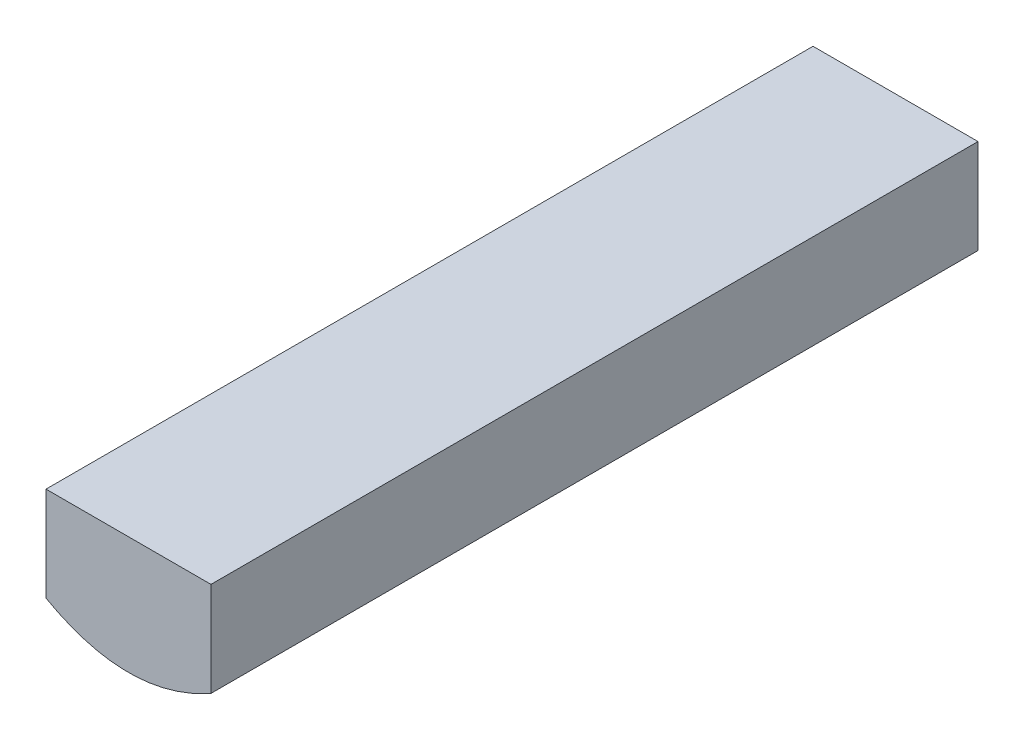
from build123d import *

# Parameters (mm, degrees)
BOSS_EXTRUDE2_DEPTH = 331.382
SKETCH5_W           = 260
SKETCH5_H           = 120
CUT_EXTRUDE4_DEPTH  = 377.924435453
SKETCH6_W           = 71.274118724
SKETCH6_H           = 40.8
BOSS_EXTRUDE3_DEPTH = 331.382


with BuildPart() as part:
    # Sketch2 → Boss-Extrude2 (new body)
    with BuildSketch(Plane.XY):
        with BuildLine():
            Line((-127, 127), (127, 127))
            add(Edge.make_bspline(
                [(-127, 127), (0, -127), (127, 127)],
                knots=[0.056028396, 0.056028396, 0.056028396, 0.943971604, 0.943971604, 0.943971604], degree=2))
        make_face()
    extrude(amount=BOSS_EXTRUDE2_DEPTH)

    # Sketch5 → Cut-Extrude4 (cut, through all)
    with BuildSketch(Plane.XY.offset(331.382)):
        with Locations((0, 70)):
            Rectangle(SKETCH5_W, SKETCH5_H)
    extrude(amount=-CUT_EXTRUDE4_DEPTH, mode=Mode.SUBTRACT)

    # Sketch6 → Boss-Extrude3 (add)
    with BuildSketch(Plane.XY.offset(331.382)):
        with Locations((0, 30.4)):
            Rectangle(SKETCH6_W, SKETCH6_H)
    extrude(amount=-BOSS_EXTRUDE3_DEPTH)


solid = part.part
